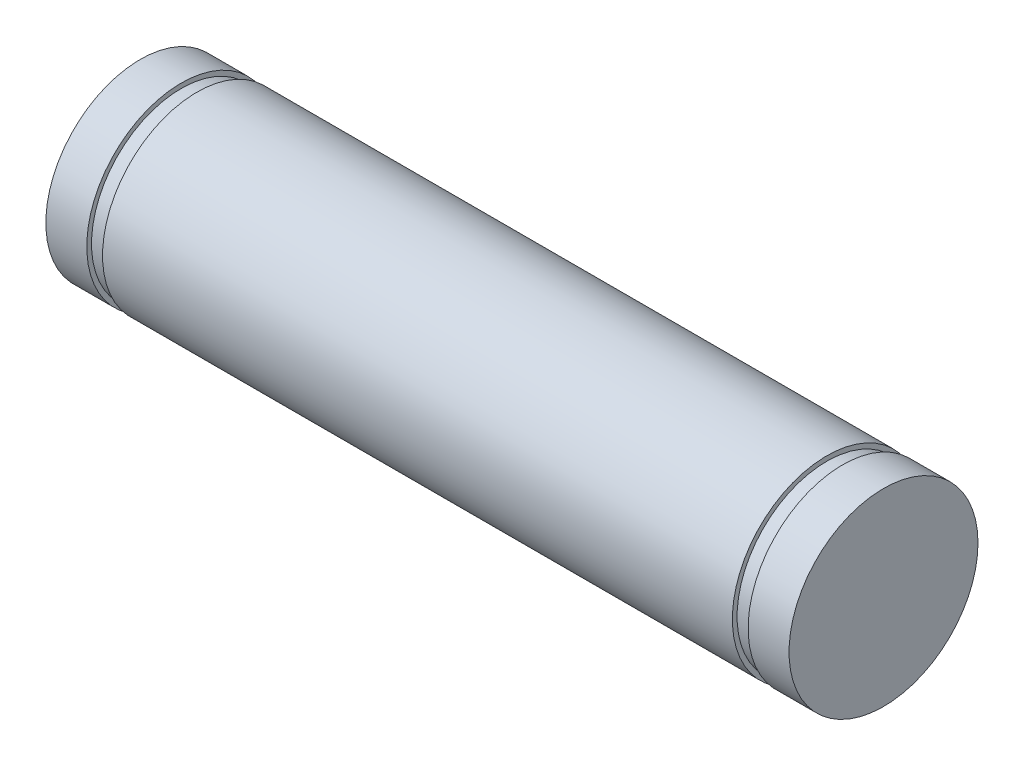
from build123d import *


with BuildPart() as part:
    # Sketch1 → Revolve1 (revolve)
    with BuildSketch(Plane(origin=(0, 0, 0), x_dir=(1, 0, 0), z_dir=(0, 1, 0))):
        Polygon((11.8, 0), (-11.8, 0), (-11.8, 3), (-10.5, 3), (-10.5, 2.85), (-10, 2.85), (-10, 3), (10, 3), (10, 2.85), (10.5, 2.85), (10.5, 3), (11.8, 3), align=None)
    revolve(axis=Axis((11.8, 0, 0), (-1, 0, 0)))


solid = part.part
